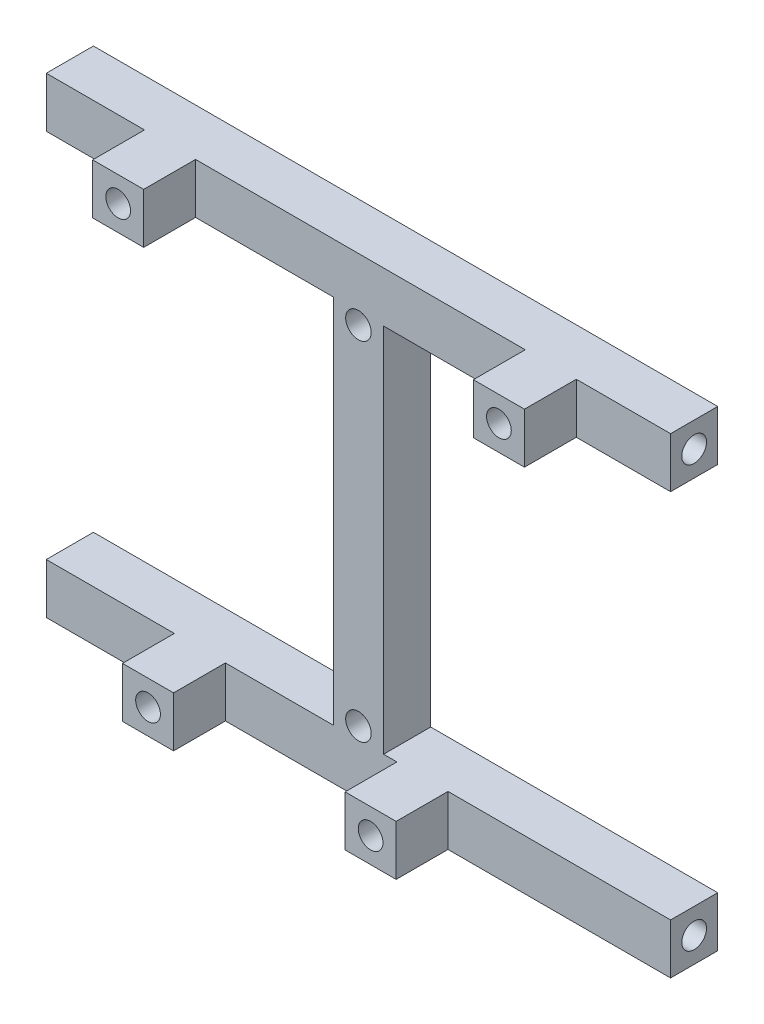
ISO-10303-21;
HEADER;
FILE_DESCRIPTION(('STEP AP214'),'2;1');
FILE_NAME('part.step','',(''),(''),'','','');
FILE_SCHEMA(('AUTOMOTIVE_DESIGN { 1 0 10303 214 1 1 1 1 }'));
ENDSEC;
DATA;
#1=APPLICATION_CONTEXT('core data for automotive mechanical design processes');
#2=APPLICATION_PROTOCOL_DEFINITION('international standard','automotive_design',2000,#1);
#3=PRODUCT_CONTEXT('',#1,'mechanical');
#4=PRODUCT('Part','Part','',(#3));
#5=PRODUCT_RELATED_PRODUCT_CATEGORY('part','',(#4));
#6=PRODUCT_DEFINITION_FORMATION('','',#4);
#7=PRODUCT_DEFINITION_CONTEXT('part definition',#1,'design');
#8=PRODUCT_DEFINITION('design','',#6,#7);
#9=PRODUCT_DEFINITION_SHAPE('','',#8);
#10=(LENGTH_UNIT() NAMED_UNIT(*) SI_UNIT(.MILLI.,.METRE.));
#11=(NAMED_UNIT(*) PLANE_ANGLE_UNIT() SI_UNIT($,.RADIAN.));
#12=(NAMED_UNIT(*) SI_UNIT($,.STERADIAN.) SOLID_ANGLE_UNIT());
#13=UNCERTAINTY_MEASURE_WITH_UNIT(LENGTH_MEASURE(1.E-05),#10,'distance_accuracy_value','');
#14=(GEOMETRIC_REPRESENTATION_CONTEXT(3) GLOBAL_UNCERTAINTY_ASSIGNED_CONTEXT((#13)) GLOBAL_UNIT_ASSIGNED_CONTEXT((#10,
#11,#12)) REPRESENTATION_CONTEXT('',''));
#15=CARTESIAN_POINT('',(0.,0.,0.));
#16=DIRECTION('',(0.,0.,1.));
#17=DIRECTION('',(1.,0.,0.));
#18=AXIS2_PLACEMENT_3D('',#15,#16,#17);
#19=CARTESIAN_POINT('',(0.,0.,6.));
#20=DIRECTION('',(0.,0.,-1.));
#21=DIRECTION('',(-1.,0.,0.));
#22=AXIS2_PLACEMENT_3D('',#19,#20,#21);
#23=PLANE('',#22);
#24=DIRECTION('',(0.,1.,0.));
#25=VECTOR('',#24,1.);
#26=CARTESIAN_POINT('',(11.4,-30.,6.));
#27=LINE('',#26,#25);
#28=CARTESIAN_POINT('',(11.4,-30.,6.));
#29=VERTEX_POINT('',#28);
#30=CARTESIAN_POINT('',(11.4,-23.6,6.));
#31=VERTEX_POINT('',#30);
#32=EDGE_CURVE('E48',#29,#31,#27,.T.);
#33=ORIENTED_EDGE('',*,*,#32,.F.);
#34=DIRECTION('',(1.,0.,0.));
#35=VECTOR('',#34,1.);
#36=CARTESIAN_POINT('',(-39.73,-30.,6.));
#37=LINE('',#36,#35);
#38=CARTESIAN_POINT('',(39.73,-30.,6.));
#39=VERTEX_POINT('',#38);
#40=EDGE_CURVE('E242',#29,#39,#37,.T.);
#41=ORIENTED_EDGE('',*,*,#40,.T.);
#42=DIRECTION('',(0.,1.,0.));
#43=VECTOR('',#42,1.);
#44=CARTESIAN_POINT('',(39.73,-23.6,6.));
#45=LINE('',#44,#43);
#46=CARTESIAN_POINT('',(39.73,-23.6,6.));
#47=VERTEX_POINT('',#46);
#48=EDGE_CURVE('E352',#39,#47,#45,.T.);
#49=ORIENTED_EDGE('',*,*,#48,.T.);
#50=DIRECTION('',(-1.,0.,0.));
#51=VECTOR('',#50,1.);
#52=CARTESIAN_POINT('',(3.20000000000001,-23.6,6.));
#53=LINE('',#52,#51);
#54=EDGE_CURVE('E355',#47,#31,#53,.T.);
#55=ORIENTED_EDGE('',*,*,#54,.T.);
#56=EDGE_LOOP('',(#33,#41,#49,#55));
#57=FACE_BOUND('',#56,.T.);
#58=ADVANCED_FACE('F33',(#57),#23,.F.);
#59=CARTESIAN_POINT('',(0.,22.1,6.));
#60=DIRECTION('',(0.,0.,1.));
#61=DIRECTION('',(1.,0.,0.));
#62=AXIS2_PLACEMENT_3D('',#59,#60,#61);
#63=CIRCLE('',#62,1.625);
#64=CARTESIAN_POINT('',(1.62500000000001,22.1,6.));
#65=VERTEX_POINT('',#64);
#66=EDGE_CURVE('E1034',#65,#65,#63,.T.);
#67=ORIENTED_EDGE('',*,*,#66,.F.);
#68=EDGE_LOOP('',(#67));
#69=FACE_BOUND('',#68,.T.);
#70=CARTESIAN_POINT('',(0.,-22.1,6.));
#71=DIRECTION('',(0.,0.,1.));
#72=DIRECTION('',(1.,0.,0.));
#73=AXIS2_PLACEMENT_3D('',#70,#71,#72);
#74=CIRCLE('',#73,1.625);
#75=CARTESIAN_POINT('',(1.62500000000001,-22.1,6.));
#76=VERTEX_POINT('',#75);
#77=EDGE_CURVE('E1025',#76,#76,#74,.T.);
#78=ORIENTED_EDGE('',*,*,#77,.F.);
#79=EDGE_LOOP('',(#78));
#80=FACE_BOUND('',#79,.T.);
#81=DIRECTION('',(0.,-1.,0.));
#82=VECTOR('',#81,1.);
#83=CARTESIAN_POINT('',(4.90000000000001,-30.,6.));
#84=LINE('',#83,#82);
#85=CARTESIAN_POINT('',(4.90000000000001,-23.6,6.));
#86=VERTEX_POINT('',#85);
#87=CARTESIAN_POINT('',(4.90000000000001,-30.,6.));
#88=VERTEX_POINT('',#87);
#89=EDGE_CURVE('E238',#86,#88,#84,.T.);
#90=ORIENTED_EDGE('',*,*,#89,.F.);
#91=CARTESIAN_POINT('',(3.20000000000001,-23.6,6.));
#92=VERTEX_POINT('',#91);
#93=EDGE_CURVE('E354',#86,#92,#53,.T.);
#94=ORIENTED_EDGE('',*,*,#93,.T.);
#95=DIRECTION('',(0.,1.,0.));
#96=VECTOR('',#95,1.);
#97=CARTESIAN_POINT('',(3.20000000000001,-23.6,6.));
#98=LINE('',#97,#96);
#99=CARTESIAN_POINT('',(3.20000000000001,23.6,6.));
#100=VERTEX_POINT('',#99);
#101=EDGE_CURVE('E357',#92,#100,#98,.T.);
#102=ORIENTED_EDGE('',*,*,#101,.T.);
#103=DIRECTION('',(1.,0.,0.));
#104=VECTOR('',#103,1.);
#105=CARTESIAN_POINT('',(3.20000000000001,23.6,6.));
#106=LINE('',#105,#104);
#107=CARTESIAN_POINT('',(21.23,23.6,6.));
#108=VERTEX_POINT('',#107);
#109=EDGE_CURVE('E360',#100,#108,#106,.T.);
#110=ORIENTED_EDGE('',*,*,#109,.T.);
#111=DIRECTION('',(0.,-1.,0.));
#112=VECTOR('',#111,1.);
#113=CARTESIAN_POINT('',(21.23,30.,6.));
#114=LINE('',#113,#112);
#115=CARTESIAN_POINT('',(21.23,30.,6.));
#116=VERTEX_POINT('',#115);
#117=EDGE_CURVE('E280',#116,#108,#114,.T.);
#118=ORIENTED_EDGE('',*,*,#117,.F.);
#119=DIRECTION('',(-1.,0.,0.));
#120=VECTOR('',#119,1.);
#121=CARTESIAN_POINT('',(-39.73,30.,6.));
#122=LINE('',#121,#120);
#123=CARTESIAN_POINT('',(-20.73,30.,6.));
#124=VERTEX_POINT('',#123);
#125=EDGE_CURVE('E338',#116,#124,#122,.T.);
#126=ORIENTED_EDGE('',*,*,#125,.T.);
#127=DIRECTION('',(0.,1.,0.));
#128=VECTOR('',#127,1.);
#129=CARTESIAN_POINT('',(-20.73,23.6,6.));
#130=LINE('',#129,#128);
#131=CARTESIAN_POINT('',(-20.73,23.6,6.));
#132=VERTEX_POINT('',#131);
#133=EDGE_CURVE('E302',#132,#124,#130,.T.);
#134=ORIENTED_EDGE('',*,*,#133,.F.);
#135=DIRECTION('',(1.,0.,0.));
#136=VECTOR('',#135,1.);
#137=CARTESIAN_POINT('',(-39.73,23.6,6.));
#138=LINE('',#137,#136);
#139=CARTESIAN_POINT('',(-3.19999999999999,23.6,6.));
#140=VERTEX_POINT('',#139);
#141=EDGE_CURVE('E340',#132,#140,#138,.T.);
#142=ORIENTED_EDGE('',*,*,#141,.T.);
#143=DIRECTION('',(0.,-1.,0.));
#144=VECTOR('',#143,1.);
#145=CARTESIAN_POINT('',(-3.19999999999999,-23.6,6.));
#146=LINE('',#145,#144);
#147=CARTESIAN_POINT('',(-3.19999999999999,-23.6,6.));
#148=VERTEX_POINT('',#147);
#149=EDGE_CURVE('E343',#140,#148,#146,.T.);
#150=ORIENTED_EDGE('',*,*,#149,.T.);
#151=DIRECTION('',(-1.,0.,0.));
#152=VECTOR('',#151,1.);
#153=CARTESIAN_POINT('',(-39.73,-23.6,6.));
#154=LINE('',#153,#152);
#155=CARTESIAN_POINT('',(-16.93,-23.6,6.));
#156=VERTEX_POINT('',#155);
#157=EDGE_CURVE('E346',#148,#156,#154,.T.);
#158=ORIENTED_EDGE('',*,*,#157,.T.);
#159=DIRECTION('',(0.,1.,0.));
#160=VECTOR('',#159,1.);
#161=CARTESIAN_POINT('',(-16.93,-30.,6.));
#162=LINE('',#161,#160);
#163=CARTESIAN_POINT('',(-16.93,-30.,6.));
#164=VERTEX_POINT('',#163);
#165=EDGE_CURVE('E246',#164,#156,#162,.T.);
#166=ORIENTED_EDGE('',*,*,#165,.F.);
#167=EDGE_CURVE('E56',#164,#88,#37,.T.);
#168=ORIENTED_EDGE('',*,*,#167,.T.);
#169=EDGE_LOOP('',(#90,#94,#102,#110,#118,#126,#134,#142,#150,#158,#166,#168));
#170=FACE_BOUND('',#169,.T.);
#171=ADVANCED_FACE('F439',(#69,#80,#170),#23,.F.);
#172=DIRECTION('',(0.,-1.,0.));
#173=VECTOR('',#172,1.);
#174=CARTESIAN_POINT('',(-23.43,-30.,6.));
#175=LINE('',#174,#173);
#176=CARTESIAN_POINT('',(-23.43,-23.6,6.));
#177=VERTEX_POINT('',#176);
#178=CARTESIAN_POINT('',(-23.43,-30.,6.));
#179=VERTEX_POINT('',#178);
#180=EDGE_CURVE('E243',#177,#179,#175,.T.);
#181=ORIENTED_EDGE('',*,*,#180,.F.);
#182=CARTESIAN_POINT('',(-39.73,-23.6,6.));
#183=VERTEX_POINT('',#182);
#184=EDGE_CURVE('E345',#177,#183,#154,.T.);
#185=ORIENTED_EDGE('',*,*,#184,.T.);
#186=DIRECTION('',(0.,-1.,0.));
#187=VECTOR('',#186,1.);
#188=CARTESIAN_POINT('',(-39.73,-30.,6.));
#189=LINE('',#188,#187);
#190=CARTESIAN_POINT('',(-39.73,-30.,6.));
#191=VERTEX_POINT('',#190);
#192=EDGE_CURVE('E348',#183,#191,#189,.T.);
#193=ORIENTED_EDGE('',*,*,#192,.T.);
#194=EDGE_CURVE('E350',#191,#179,#37,.T.);
#195=ORIENTED_EDGE('',*,*,#194,.T.);
#196=EDGE_LOOP('',(#181,#185,#193,#195));
#197=FACE_BOUND('',#196,.T.);
#198=ADVANCED_FACE('F541',(#197),#23,.F.);
#199=DIRECTION('',(0.,1.,0.));
#200=VECTOR('',#199,1.);
#201=CARTESIAN_POINT('',(27.73,30.,6.));
#202=LINE('',#201,#200);
#203=CARTESIAN_POINT('',(27.73,23.6,6.));
#204=VERTEX_POINT('',#203);
#205=CARTESIAN_POINT('',(27.73,30.,6.));
#206=VERTEX_POINT('',#205);
#207=EDGE_CURVE('E275',#204,#206,#202,.T.);
#208=ORIENTED_EDGE('',*,*,#207,.F.);
#209=CARTESIAN_POINT('',(39.73,23.6,6.));
#210=VERTEX_POINT('',#209);
#211=EDGE_CURVE('E359',#204,#210,#106,.T.);
#212=ORIENTED_EDGE('',*,*,#211,.T.);
#213=DIRECTION('',(0.,1.,0.));
#214=VECTOR('',#213,1.);
#215=CARTESIAN_POINT('',(39.73,23.6,6.));
#216=LINE('',#215,#214);
#217=CARTESIAN_POINT('',(39.73,30.,6.));
#218=VERTEX_POINT('',#217);
#219=EDGE_CURVE('E330',#210,#218,#216,.T.);
#220=ORIENTED_EDGE('',*,*,#219,.T.);
#221=EDGE_CURVE('E335',#218,#206,#122,.T.);
#222=ORIENTED_EDGE('',*,*,#221,.T.);
#223=EDGE_LOOP('',(#208,#212,#220,#222));
#224=FACE_BOUND('',#223,.T.);
#225=ADVANCED_FACE('F472',(#224),#23,.F.);
#226=DIRECTION('',(0.,-1.,0.));
#227=VECTOR('',#226,1.);
#228=CARTESIAN_POINT('',(-27.23,23.6,6.));
#229=LINE('',#228,#227);
#230=CARTESIAN_POINT('',(-27.23,30.,6.));
#231=VERTEX_POINT('',#230);
#232=CARTESIAN_POINT('',(-27.23,23.6,6.));
#233=VERTEX_POINT('',#232);
#234=EDGE_CURVE('E307',#231,#233,#229,.T.);
#235=ORIENTED_EDGE('',*,*,#234,.F.);
#236=CARTESIAN_POINT('',(-39.73,30.,6.));
#237=VERTEX_POINT('',#236);
#238=EDGE_CURVE('E333',#231,#237,#122,.T.);
#239=ORIENTED_EDGE('',*,*,#238,.T.);
#240=DIRECTION('',(0.,-1.,0.));
#241=VECTOR('',#240,1.);
#242=CARTESIAN_POINT('',(-39.73,23.6,6.));
#243=LINE('',#242,#241);
#244=CARTESIAN_POINT('',(-39.73,23.6,6.));
#245=VERTEX_POINT('',#244);
#246=EDGE_CURVE('E337',#237,#245,#243,.T.);
#247=ORIENTED_EDGE('',*,*,#246,.T.);
#248=EDGE_CURVE('E341',#245,#233,#138,.T.);
#249=ORIENTED_EDGE('',*,*,#248,.T.);
#250=EDGE_LOOP('',(#235,#239,#247,#249));
#251=FACE_BOUND('',#250,.T.);
#252=ADVANCED_FACE('F454',(#251),#23,.F.);
#253=CARTESIAN_POINT('',(39.73,23.6,6.));
#254=DIRECTION('',(-1.,0.,0.));
#255=DIRECTION('',(0.,0.,1.));
#256=AXIS2_PLACEMENT_3D('',#253,#254,#255);
#257=PLANE('',#256);
#258=CARTESIAN_POINT('',(39.73,26.8,3.));
#259=DIRECTION('',(1.,0.,0.));
#260=DIRECTION('',(0.,0.,-1.));
#261=AXIS2_PLACEMENT_3D('',#258,#259,#260);
#262=CIRCLE('',#261,1.575);
#263=CARTESIAN_POINT('',(39.73,26.8,1.425));
#264=VERTEX_POINT('',#263);
#265=EDGE_CURVE('E1007',#264,#264,#262,.T.);
#266=ORIENTED_EDGE('',*,*,#265,.F.);
#267=EDGE_LOOP('',(#266));
#268=FACE_BOUND('',#267,.T.);
#269=DIRECTION('',(0.,1.,0.));
#270=VECTOR('',#269,1.);
#271=CARTESIAN_POINT('',(39.73,23.6,0.));
#272=LINE('',#271,#270);
#273=CARTESIAN_POINT('',(39.73,23.6,0.));
#274=VERTEX_POINT('',#273);
#275=CARTESIAN_POINT('',(39.73,30.,0.));
#276=VERTEX_POINT('',#275);
#277=EDGE_CURVE('E329',#274,#276,#272,.T.);
#278=ORIENTED_EDGE('',*,*,#277,.T.);
#279=DIRECTION('',(0.,0.,-1.));
#280=VECTOR('',#279,1.);
#281=CARTESIAN_POINT('',(39.73,30.,6.));
#282=LINE('',#281,#280);
#283=EDGE_CURVE('E11',#218,#276,#282,.T.);
#284=ORIENTED_EDGE('',*,*,#283,.F.);
#285=ORIENTED_EDGE('',*,*,#219,.F.);
#286=DIRECTION('',(0.,0.,-1.));
#287=VECTOR('',#286,1.);
#288=CARTESIAN_POINT('',(39.73,23.6,6.));
#289=LINE('',#288,#287);
#290=EDGE_CURVE('E362',#210,#274,#289,.T.);
#291=ORIENTED_EDGE('',*,*,#290,.T.);
#292=EDGE_LOOP('',(#278,#284,#285,#291));
#293=FACE_BOUND('',#292,.T.);
#294=ADVANCED_FACE('F35',(#268,#293),#257,.F.);
#295=CARTESIAN_POINT('',(-39.73,30.,6.));
#296=DIRECTION('',(0.,-1.,0.));
#297=DIRECTION('',(0.,0.,-1.));
#298=AXIS2_PLACEMENT_3D('',#295,#296,#297);
#299=PLANE('',#298);
#300=DIRECTION('',(-1.,0.,0.));
#301=VECTOR('',#300,1.);
#302=CARTESIAN_POINT('',(-39.73,30.,0.));
#303=LINE('',#302,#301);
#304=CARTESIAN_POINT('',(-39.73,30.,0.));
#305=VERTEX_POINT('',#304);
#306=EDGE_CURVE('E365',#276,#305,#303,.T.);
#307=ORIENTED_EDGE('',*,*,#306,.T.);
#308=DIRECTION('',(0.,0.,-1.));
#309=VECTOR('',#308,1.);
#310=CARTESIAN_POINT('',(-39.73,30.,6.));
#311=LINE('',#310,#309);
#312=EDGE_CURVE('E41',#237,#305,#311,.T.);
#313=ORIENTED_EDGE('',*,*,#312,.F.);
#314=ORIENTED_EDGE('',*,*,#238,.F.);
#315=DIRECTION('',(0.,0.,-1.));
#316=VECTOR('',#315,1.);
#317=CARTESIAN_POINT('',(-27.23,30.,12.6));
#318=LINE('',#317,#316);
#319=CARTESIAN_POINT('',(-27.23,30.,12.6));
#320=VERTEX_POINT('',#319);
#321=EDGE_CURVE('E320',#320,#231,#318,.T.);
#322=ORIENTED_EDGE('',*,*,#321,.F.);
#323=DIRECTION('',(-1.,0.,0.));
#324=VECTOR('',#323,1.);
#325=CARTESIAN_POINT('',(-27.23,30.,12.6));
#326=LINE('',#325,#324);
#327=CARTESIAN_POINT('',(-20.73,30.,12.6));
#328=VERTEX_POINT('',#327);
#329=EDGE_CURVE('E309',#328,#320,#326,.T.);
#330=ORIENTED_EDGE('',*,*,#329,.F.);
#331=DIRECTION('',(0.,0.,-1.));
#332=VECTOR('',#331,1.);
#333=CARTESIAN_POINT('',(-20.73,30.,12.6));
#334=LINE('',#333,#332);
#335=EDGE_CURVE('E323',#328,#124,#334,.T.);
#336=ORIENTED_EDGE('',*,*,#335,.T.);
#337=ORIENTED_EDGE('',*,*,#125,.F.);
#338=DIRECTION('',(0.,0.,-1.));
#339=VECTOR('',#338,1.);
#340=CARTESIAN_POINT('',(21.23,30.,12.6));
#341=LINE('',#340,#339);
#342=CARTESIAN_POINT('',(21.23,30.,12.6));
#343=VERTEX_POINT('',#342);
#344=EDGE_CURVE('E296',#343,#116,#341,.T.);
#345=ORIENTED_EDGE('',*,*,#344,.F.);
#346=DIRECTION('',(-1.,0.,0.));
#347=VECTOR('',#346,1.);
#348=CARTESIAN_POINT('',(27.73,30.,12.6));
#349=LINE('',#348,#347);
#350=CARTESIAN_POINT('',(27.73,30.,12.6));
#351=VERTEX_POINT('',#350);
#352=EDGE_CURVE('E279',#351,#343,#349,.T.);
#353=ORIENTED_EDGE('',*,*,#352,.F.);
#354=DIRECTION('',(0.,0.,-1.));
#355=VECTOR('',#354,1.);
#356=CARTESIAN_POINT('',(27.73,30.,12.6));
#357=LINE('',#356,#355);
#358=EDGE_CURVE('E299',#351,#206,#357,.T.);
#359=ORIENTED_EDGE('',*,*,#358,.T.);
#360=ORIENTED_EDGE('',*,*,#221,.F.);
#361=ORIENTED_EDGE('',*,*,#283,.T.);
#362=EDGE_LOOP('',(#307,#313,#314,#322,#330,#336,#337,#345,#353,#359,#360,#361));
#363=FACE_BOUND('',#362,.T.);
#364=ADVANCED_FACE('F455',(#363),#299,.F.);
#365=CARTESIAN_POINT('',(-39.73,23.6,6.));
#366=DIRECTION('',(1.,0.,0.));
#367=DIRECTION('',(0.,0.,-1.));
#368=AXIS2_PLACEMENT_3D('',#365,#366,#367);
#369=PLANE('',#368);
#370=CARTESIAN_POINT('',(-39.73,26.8,3.));
#371=DIRECTION('',(-1.,0.,0.));
#372=DIRECTION('',(0.,0.,1.));
#373=AXIS2_PLACEMENT_3D('',#370,#371,#372);
#374=CIRCLE('',#373,1.575);
#375=CARTESIAN_POINT('',(-39.73,26.8,4.575));
#376=VERTEX_POINT('',#375);
#377=EDGE_CURVE('E1008',#376,#376,#374,.T.);
#378=ORIENTED_EDGE('',*,*,#377,.F.);
#379=EDGE_LOOP('',(#378));
#380=FACE_BOUND('',#379,.T.);
#381=DIRECTION('',(0.,-1.,0.));
#382=VECTOR('',#381,1.);
#383=CARTESIAN_POINT('',(-39.73,23.6,0.));
#384=LINE('',#383,#382);
#385=CARTESIAN_POINT('',(-39.73,23.6,0.));
#386=VERTEX_POINT('',#385);
#387=EDGE_CURVE('E367',#305,#386,#384,.T.);
#388=ORIENTED_EDGE('',*,*,#387,.T.);
#389=DIRECTION('',(0.,0.,-1.));
#390=VECTOR('',#389,1.);
#391=CARTESIAN_POINT('',(-39.73,23.6,6.));
#392=LINE('',#391,#390);
#393=EDGE_CURVE('E412',#245,#386,#392,.T.);
#394=ORIENTED_EDGE('',*,*,#393,.F.);
#395=ORIENTED_EDGE('',*,*,#246,.F.);
#396=ORIENTED_EDGE('',*,*,#312,.T.);
#397=EDGE_LOOP('',(#388,#394,#395,#396));
#398=FACE_BOUND('',#397,.T.);
#399=ADVANCED_FACE('F419',(#380,#398),#369,.F.);
#400=CARTESIAN_POINT('',(-39.73,23.6,6.));
#401=DIRECTION('',(0.,1.,0.));
#402=DIRECTION('',(0.,0.,1.));
#403=AXIS2_PLACEMENT_3D('',#400,#401,#402);
#404=PLANE('',#403);
#405=DIRECTION('',(1.,0.,0.));
#406=VECTOR('',#405,1.);
#407=CARTESIAN_POINT('',(-39.73,23.6,0.));
#408=LINE('',#407,#406);
#409=CARTESIAN_POINT('',(-3.19999999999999,23.6,0.));
#410=VERTEX_POINT('',#409);
#411=EDGE_CURVE('E369',#386,#410,#408,.T.);
#412=ORIENTED_EDGE('',*,*,#411,.T.);
#413=DIRECTION('',(0.,0.,-1.));
#414=VECTOR('',#413,1.);
#415=CARTESIAN_POINT('',(-3.19999999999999,23.6,6.));
#416=LINE('',#415,#414);
#417=EDGE_CURVE('E409',#140,#410,#416,.T.);
#418=ORIENTED_EDGE('',*,*,#417,.F.);
#419=ORIENTED_EDGE('',*,*,#141,.F.);
#420=DIRECTION('',(0.,0.,-1.));
#421=VECTOR('',#420,1.);
#422=CARTESIAN_POINT('',(-20.73,23.6,12.6));
#423=LINE('',#422,#421);
#424=CARTESIAN_POINT('',(-20.73,23.6,12.6));
#425=VERTEX_POINT('',#424);
#426=EDGE_CURVE('E326',#425,#132,#423,.T.);
#427=ORIENTED_EDGE('',*,*,#426,.F.);
#428=DIRECTION('',(1.,0.,0.));
#429=VECTOR('',#428,1.);
#430=CARTESIAN_POINT('',(-20.73,23.6,12.6));
#431=LINE('',#430,#429);
#432=CARTESIAN_POINT('',(-27.23,23.6,12.6));
#433=VERTEX_POINT('',#432);
#434=EDGE_CURVE('E303',#433,#425,#431,.T.);
#435=ORIENTED_EDGE('',*,*,#434,.F.);
#436=DIRECTION('',(0.,0.,-1.));
#437=VECTOR('',#436,1.);
#438=CARTESIAN_POINT('',(-27.23,23.6,12.6));
#439=LINE('',#438,#437);
#440=EDGE_CURVE('E313',#433,#233,#439,.T.);
#441=ORIENTED_EDGE('',*,*,#440,.T.);
#442=ORIENTED_EDGE('',*,*,#248,.F.);
#443=ORIENTED_EDGE('',*,*,#393,.T.);
#444=EDGE_LOOP('',(#412,#418,#419,#427,#435,#441,#442,#443));
#445=FACE_BOUND('',#444,.T.);
#446=ADVANCED_FACE('F431',(#445),#404,.F.);
#447=CARTESIAN_POINT('',(-3.19999999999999,-23.6,6.));
#448=DIRECTION('',(1.,0.,0.));
#449=DIRECTION('',(0.,0.,-1.));
#450=AXIS2_PLACEMENT_3D('',#447,#448,#449);
#451=PLANE('',#450);
#452=DIRECTION('',(0.,-1.,0.));
#453=VECTOR('',#452,1.);
#454=CARTESIAN_POINT('',(-3.19999999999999,-23.6,0.));
#455=LINE('',#454,#453);
#456=CARTESIAN_POINT('',(-3.19999999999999,-23.6,0.));
#457=VERTEX_POINT('',#456);
#458=EDGE_CURVE('E371',#410,#457,#455,.T.);
#459=ORIENTED_EDGE('',*,*,#458,.T.);
#460=DIRECTION('',(0.,0.,-1.));
#461=VECTOR('',#460,1.);
#462=CARTESIAN_POINT('',(-3.19999999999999,-23.6,6.));
#463=LINE('',#462,#461);
#464=EDGE_CURVE('E406',#148,#457,#463,.T.);
#465=ORIENTED_EDGE('',*,*,#464,.F.);
#466=ORIENTED_EDGE('',*,*,#149,.F.);
#467=ORIENTED_EDGE('',*,*,#417,.T.);
#468=EDGE_LOOP('',(#459,#465,#466,#467));
#469=FACE_BOUND('',#468,.T.);
#470=ADVANCED_FACE('F436',(#469),#451,.F.);
#471=CARTESIAN_POINT('',(-39.73,-23.6,6.));
#472=DIRECTION('',(0.,-1.,0.));
#473=DIRECTION('',(0.,0.,-1.));
#474=AXIS2_PLACEMENT_3D('',#471,#472,#473);
#475=PLANE('',#474);
#476=DIRECTION('',(-1.,0.,0.));
#477=VECTOR('',#476,1.);
#478=CARTESIAN_POINT('',(-39.73,-23.6,0.));
#479=LINE('',#478,#477);
#480=CARTESIAN_POINT('',(-39.73,-23.6,0.));
#481=VERTEX_POINT('',#480);
#482=EDGE_CURVE('E373',#457,#481,#479,.T.);
#483=ORIENTED_EDGE('',*,*,#482,.T.);
#484=DIRECTION('',(0.,0.,-1.));
#485=VECTOR('',#484,1.);
#486=CARTESIAN_POINT('',(-39.73,-23.6,6.));
#487=LINE('',#486,#485);
#488=EDGE_CURVE('E403',#183,#481,#487,.T.);
#489=ORIENTED_EDGE('',*,*,#488,.F.);
#490=ORIENTED_EDGE('',*,*,#184,.F.);
#491=DIRECTION('',(0.,0.,-1.));
#492=VECTOR('',#491,1.);
#493=CARTESIAN_POINT('',(-23.43,-23.6,12.6));
#494=LINE('',#493,#492);
#495=CARTESIAN_POINT('',(-23.43,-23.6,12.6));
#496=VERTEX_POINT('',#495);
#497=EDGE_CURVE('E260',#496,#177,#494,.T.);
#498=ORIENTED_EDGE('',*,*,#497,.F.);
#499=DIRECTION('',(-1.,0.,0.));
#500=VECTOR('',#499,1.);
#501=CARTESIAN_POINT('',(-16.93,-23.6,12.6));
#502=LINE('',#501,#500);
#503=CARTESIAN_POINT('',(-16.93,-23.6,12.6));
#504=VERTEX_POINT('',#503);
#505=EDGE_CURVE('E259',#504,#496,#502,.T.);
#506=ORIENTED_EDGE('',*,*,#505,.F.);
#507=DIRECTION('',(0.,0.,-1.));
#508=VECTOR('',#507,1.);
#509=CARTESIAN_POINT('',(-16.93,-23.6,12.6));
#510=LINE('',#509,#508);
#511=EDGE_CURVE('E266',#504,#156,#510,.T.);
#512=ORIENTED_EDGE('',*,*,#511,.T.);
#513=ORIENTED_EDGE('',*,*,#157,.F.);
#514=ORIENTED_EDGE('',*,*,#464,.T.);
#515=EDGE_LOOP('',(#483,#489,#490,#498,#506,#512,#513,#514));
#516=FACE_BOUND('',#515,.T.);
#517=ADVANCED_FACE('F506',(#516),#475,.F.);
#518=CARTESIAN_POINT('',(-39.73,-30.,6.));
#519=DIRECTION('',(1.,0.,0.));
#520=DIRECTION('',(0.,0.,-1.));
#521=AXIS2_PLACEMENT_3D('',#518,#519,#520);
#522=PLANE('',#521);
#523=CARTESIAN_POINT('',(-39.73,-26.8,3.));
#524=DIRECTION('',(-1.,0.,0.));
#525=DIRECTION('',(0.,0.,1.));
#526=AXIS2_PLACEMENT_3D('',#523,#524,#525);
#527=CIRCLE('',#526,1.575);
#528=CARTESIAN_POINT('',(-39.73,-26.8,4.575));
#529=VERTEX_POINT('',#528);
#530=EDGE_CURVE('E1019',#529,#529,#527,.T.);
#531=ORIENTED_EDGE('',*,*,#530,.F.);
#532=EDGE_LOOP('',(#531));
#533=FACE_BOUND('',#532,.T.);
#534=DIRECTION('',(0.,-1.,0.));
#535=VECTOR('',#534,1.);
#536=CARTESIAN_POINT('',(-39.73,-30.,0.));
#537=LINE('',#536,#535);
#538=CARTESIAN_POINT('',(-39.73,-30.,0.));
#539=VERTEX_POINT('',#538);
#540=EDGE_CURVE('E375',#481,#539,#537,.T.);
#541=ORIENTED_EDGE('',*,*,#540,.T.);
#542=DIRECTION('',(0.,0.,-1.));
#543=VECTOR('',#542,1.);
#544=CARTESIAN_POINT('',(-39.73,-30.,6.));
#545=LINE('',#544,#543);
#546=EDGE_CURVE('E400',#191,#539,#545,.T.);
#547=ORIENTED_EDGE('',*,*,#546,.F.);
#548=ORIENTED_EDGE('',*,*,#192,.F.);
#549=ORIENTED_EDGE('',*,*,#488,.T.);
#550=EDGE_LOOP('',(#541,#547,#548,#549));
#551=FACE_BOUND('',#550,.T.);
#552=ADVANCED_FACE('F503',(#533,#551),#522,.F.);
#553=CARTESIAN_POINT('',(-39.73,-30.,6.));
#554=DIRECTION('',(0.,1.,0.));
#555=DIRECTION('',(0.,0.,1.));
#556=AXIS2_PLACEMENT_3D('',#553,#554,#555);
#557=PLANE('',#556);
#558=DIRECTION('',(1.,0.,0.));
#559=VECTOR('',#558,1.);
#560=CARTESIAN_POINT('',(-39.73,-30.,0.));
#561=LINE('',#560,#559);
#562=CARTESIAN_POINT('',(39.73,-30.,0.));
#563=VERTEX_POINT('',#562);
#564=EDGE_CURVE('E377',#539,#563,#561,.T.);
#565=ORIENTED_EDGE('',*,*,#564,.T.);
#566=DIRECTION('',(0.,0.,-1.));
#567=VECTOR('',#566,1.);
#568=CARTESIAN_POINT('',(39.73,-30.,6.));
#569=LINE('',#568,#567);
#570=EDGE_CURVE('E397',#39,#563,#569,.T.);
#571=ORIENTED_EDGE('',*,*,#570,.F.);
#572=ORIENTED_EDGE('',*,*,#40,.F.);
#573=DIRECTION('',(0.,0.,-1.));
#574=VECTOR('',#573,1.);
#575=CARTESIAN_POINT('',(11.4,-30.,12.6));
#576=LINE('',#575,#574);
#577=CARTESIAN_POINT('',(11.4,-30.,12.6));
#578=VERTEX_POINT('',#577);
#579=EDGE_CURVE('E223',#578,#29,#576,.T.);
#580=ORIENTED_EDGE('',*,*,#579,.F.);
#581=DIRECTION('',(1.,0.,0.));
#582=VECTOR('',#581,1.);
#583=CARTESIAN_POINT('',(11.4,-30.,12.6));
#584=LINE('',#583,#582);
#585=CARTESIAN_POINT('',(4.90000000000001,-30.,12.6));
#586=VERTEX_POINT('',#585);
#587=EDGE_CURVE('E229',#586,#578,#584,.T.);
#588=ORIENTED_EDGE('',*,*,#587,.F.);
#589=DIRECTION('',(0.,0.,-1.));
#590=VECTOR('',#589,1.);
#591=CARTESIAN_POINT('',(4.90000000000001,-30.,12.6));
#592=LINE('',#591,#590);
#593=EDGE_CURVE('E515',#586,#88,#592,.T.);
#594=ORIENTED_EDGE('',*,*,#593,.T.);
#595=ORIENTED_EDGE('',*,*,#167,.F.);
#596=DIRECTION('',(0.,0.,-1.));
#597=VECTOR('',#596,1.);
#598=CARTESIAN_POINT('',(-16.93,-30.,12.6));
#599=LINE('',#598,#597);
#600=CARTESIAN_POINT('',(-16.93,-30.,12.6));
#601=VERTEX_POINT('',#600);
#602=EDGE_CURVE('E269',#601,#164,#599,.T.);
#603=ORIENTED_EDGE('',*,*,#602,.F.);
#604=DIRECTION('',(1.,0.,0.));
#605=VECTOR('',#604,1.);
#606=CARTESIAN_POINT('',(-23.43,-30.,12.6));
#607=LINE('',#606,#605);
#608=CARTESIAN_POINT('',(-23.43,-30.,12.6));
#609=VERTEX_POINT('',#608);
#610=EDGE_CURVE('E255',#609,#601,#607,.T.);
#611=ORIENTED_EDGE('',*,*,#610,.F.);
#612=DIRECTION('',(0.,0.,-1.));
#613=VECTOR('',#612,1.);
#614=CARTESIAN_POINT('',(-23.43,-30.,12.6));
#615=LINE('',#614,#613);
#616=EDGE_CURVE('E272',#609,#179,#615,.T.);
#617=ORIENTED_EDGE('',*,*,#616,.T.);
#618=ORIENTED_EDGE('',*,*,#194,.F.);
#619=ORIENTED_EDGE('',*,*,#546,.T.);
#620=EDGE_LOOP('',(#565,#571,#572,#580,#588,#594,#595,#603,#611,#617,#618,#619));
#621=FACE_BOUND('',#620,.T.);
#622=ADVANCED_FACE('F240',(#621),#557,.F.);
#623=CARTESIAN_POINT('',(39.73,-23.6,6.));
#624=DIRECTION('',(-1.,0.,0.));
#625=DIRECTION('',(0.,0.,1.));
#626=AXIS2_PLACEMENT_3D('',#623,#624,#625);
#627=PLANE('',#626);
#628=CARTESIAN_POINT('',(39.73,-26.8,3.));
#629=DIRECTION('',(1.,0.,0.));
#630=DIRECTION('',(0.,0.,-1.));
#631=AXIS2_PLACEMENT_3D('',#628,#629,#630);
#632=CIRCLE('',#631,1.575);
#633=CARTESIAN_POINT('',(39.73,-26.8,1.425));
#634=VERTEX_POINT('',#633);
#635=EDGE_CURVE('E1026',#634,#634,#632,.T.);
#636=ORIENTED_EDGE('',*,*,#635,.F.);
#637=EDGE_LOOP('',(#636));
#638=FACE_BOUND('',#637,.T.);
#639=DIRECTION('',(0.,1.,0.));
#640=VECTOR('',#639,1.);
#641=CARTESIAN_POINT('',(39.73,-23.6,0.));
#642=LINE('',#641,#640);
#643=CARTESIAN_POINT('',(39.73,-23.6,0.));
#644=VERTEX_POINT('',#643);
#645=EDGE_CURVE('E379',#563,#644,#642,.T.);
#646=ORIENTED_EDGE('',*,*,#645,.T.);
#647=DIRECTION('',(0.,0.,-1.));
#648=VECTOR('',#647,1.);
#649=CARTESIAN_POINT('',(39.73,-23.6,6.));
#650=LINE('',#649,#648);
#651=EDGE_CURVE('E394',#47,#644,#650,.T.);
#652=ORIENTED_EDGE('',*,*,#651,.F.);
#653=ORIENTED_EDGE('',*,*,#48,.F.);
#654=ORIENTED_EDGE('',*,*,#570,.T.);
#655=EDGE_LOOP('',(#646,#652,#653,#654));
#656=FACE_BOUND('',#655,.T.);
#657=ADVANCED_FACE('F497',(#638,#656),#627,.F.);
#658=CARTESIAN_POINT('',(3.20000000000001,-23.6,6.));
#659=DIRECTION('',(0.,-1.,0.));
#660=DIRECTION('',(0.,0.,-1.));
#661=AXIS2_PLACEMENT_3D('',#658,#659,#660);
#662=PLANE('',#661);
#663=DIRECTION('',(-1.,0.,0.));
#664=VECTOR('',#663,1.);
#665=CARTESIAN_POINT('',(3.20000000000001,-23.6,0.));
#666=LINE('',#665,#664);
#667=CARTESIAN_POINT('',(3.20000000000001,-23.6,0.));
#668=VERTEX_POINT('',#667);
#669=EDGE_CURVE('E381',#644,#668,#666,.T.);
#670=ORIENTED_EDGE('',*,*,#669,.T.);
#671=DIRECTION('',(0.,0.,-1.));
#672=VECTOR('',#671,1.);
#673=CARTESIAN_POINT('',(3.20000000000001,-23.6,6.));
#674=LINE('',#673,#672);
#675=EDGE_CURVE('E391',#92,#668,#674,.T.);
#676=ORIENTED_EDGE('',*,*,#675,.F.);
#677=ORIENTED_EDGE('',*,*,#93,.F.);
#678=DIRECTION('',(0.,0.,-1.));
#679=VECTOR('',#678,1.);
#680=CARTESIAN_POINT('',(4.90000000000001,-23.6,12.6));
#681=LINE('',#680,#679);
#682=CARTESIAN_POINT('',(4.90000000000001,-23.6,12.6));
#683=VERTEX_POINT('',#682);
#684=EDGE_CURVE('E248',#683,#86,#681,.T.);
#685=ORIENTED_EDGE('',*,*,#684,.F.);
#686=DIRECTION('',(-1.,0.,0.));
#687=VECTOR('',#686,1.);
#688=CARTESIAN_POINT('',(4.90000000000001,-23.6,12.6));
#689=LINE('',#688,#687);
#690=CARTESIAN_POINT('',(11.4,-23.6,12.6));
#691=VERTEX_POINT('',#690);
#692=EDGE_CURVE('E228',#691,#683,#689,.T.);
#693=ORIENTED_EDGE('',*,*,#692,.F.);
#694=DIRECTION('',(0.,0.,-1.));
#695=VECTOR('',#694,1.);
#696=CARTESIAN_POINT('',(11.4,-23.6,12.6));
#697=LINE('',#696,#695);
#698=EDGE_CURVE('E225',#691,#31,#697,.T.);
#699=ORIENTED_EDGE('',*,*,#698,.T.);
#700=ORIENTED_EDGE('',*,*,#54,.F.);
#701=ORIENTED_EDGE('',*,*,#651,.T.);
#702=EDGE_LOOP('',(#670,#676,#677,#685,#693,#699,#700,#701));
#703=FACE_BOUND('',#702,.T.);
#704=ADVANCED_FACE('F489',(#703),#662,.F.);
#705=CARTESIAN_POINT('',(3.20000000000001,-23.6,6.));
#706=DIRECTION('',(-1.,0.,0.));
#707=DIRECTION('',(0.,0.,1.));
#708=AXIS2_PLACEMENT_3D('',#705,#706,#707);
#709=PLANE('',#708);
#710=DIRECTION('',(0.,1.,0.));
#711=VECTOR('',#710,1.);
#712=CARTESIAN_POINT('',(3.20000000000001,-23.6,0.));
#713=LINE('',#712,#711);
#714=CARTESIAN_POINT('',(3.20000000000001,23.6,0.));
#715=VERTEX_POINT('',#714);
#716=EDGE_CURVE('E383',#668,#715,#713,.T.);
#717=ORIENTED_EDGE('',*,*,#716,.T.);
#718=DIRECTION('',(0.,0.,-1.));
#719=VECTOR('',#718,1.);
#720=CARTESIAN_POINT('',(3.20000000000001,23.6,6.));
#721=LINE('',#720,#719);
#722=EDGE_CURVE('E388',#100,#715,#721,.T.);
#723=ORIENTED_EDGE('',*,*,#722,.F.);
#724=ORIENTED_EDGE('',*,*,#101,.F.);
#725=ORIENTED_EDGE('',*,*,#675,.T.);
#726=EDGE_LOOP('',(#717,#723,#724,#725));
#727=FACE_BOUND('',#726,.T.);
#728=ADVANCED_FACE('F486',(#727),#709,.F.);
#729=CARTESIAN_POINT('',(3.20000000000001,23.6,6.));
#730=DIRECTION('',(0.,1.,0.));
#731=DIRECTION('',(0.,0.,1.));
#732=AXIS2_PLACEMENT_3D('',#729,#730,#731);
#733=PLANE('',#732);
#734=DIRECTION('',(1.,0.,0.));
#735=VECTOR('',#734,1.);
#736=CARTESIAN_POINT('',(3.20000000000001,23.6,0.));
#737=LINE('',#736,#735);
#738=EDGE_CURVE('E334',#715,#274,#737,.T.);
#739=ORIENTED_EDGE('',*,*,#738,.T.);
#740=ORIENTED_EDGE('',*,*,#290,.F.);
#741=ORIENTED_EDGE('',*,*,#211,.F.);
#742=DIRECTION('',(0.,0.,-1.));
#743=VECTOR('',#742,1.);
#744=CARTESIAN_POINT('',(27.73,23.6,12.6));
#745=LINE('',#744,#743);
#746=CARTESIAN_POINT('',(27.73,23.6,12.6));
#747=VERTEX_POINT('',#746);
#748=EDGE_CURVE('E286',#747,#204,#745,.T.);
#749=ORIENTED_EDGE('',*,*,#748,.F.);
#750=DIRECTION('',(1.,0.,0.));
#751=VECTOR('',#750,1.);
#752=CARTESIAN_POINT('',(21.23,23.6,12.6));
#753=LINE('',#752,#751);
#754=CARTESIAN_POINT('',(21.23,23.6,12.6));
#755=VERTEX_POINT('',#754);
#756=EDGE_CURVE('E284',#755,#747,#753,.T.);
#757=ORIENTED_EDGE('',*,*,#756,.F.);
#758=DIRECTION('',(0.,0.,-1.));
#759=VECTOR('',#758,1.);
#760=CARTESIAN_POINT('',(21.23,23.6,12.6));
#761=LINE('',#760,#759);
#762=EDGE_CURVE('E293',#755,#108,#761,.T.);
#763=ORIENTED_EDGE('',*,*,#762,.T.);
#764=ORIENTED_EDGE('',*,*,#109,.F.);
#765=ORIENTED_EDGE('',*,*,#722,.T.);
#766=EDGE_LOOP('',(#739,#740,#741,#749,#757,#763,#764,#765));
#767=FACE_BOUND('',#766,.T.);
#768=ADVANCED_FACE('F481',(#767),#733,.F.);
#769=CARTESIAN_POINT('',(0.,0.,0.));
#770=DIRECTION('',(0.,0.,-1.));
#771=DIRECTION('',(-1.,0.,0.));
#772=AXIS2_PLACEMENT_3D('',#769,#770,#771);
#773=PLANE('',#772);
#774=CARTESIAN_POINT('',(0.,22.1,0.));
#775=DIRECTION('',(0.,0.,1.));
#776=DIRECTION('',(1.,0.,0.));
#777=AXIS2_PLACEMENT_3D('',#774,#775,#776);
#778=CIRCLE('',#777,1.625);
#779=CARTESIAN_POINT('',(1.62500000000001,22.1,0.));
#780=VERTEX_POINT('',#779);
#781=EDGE_CURVE('E1031',#780,#780,#778,.T.);
#782=ORIENTED_EDGE('',*,*,#781,.T.);
#783=EDGE_LOOP('',(#782));
#784=FACE_BOUND('',#783,.T.);
#785=CARTESIAN_POINT('',(0.,-22.1,0.));
#786=DIRECTION('',(0.,0.,1.));
#787=DIRECTION('',(1.,0.,0.));
#788=AXIS2_PLACEMENT_3D('',#785,#786,#787);
#789=CIRCLE('',#788,1.625);
#790=CARTESIAN_POINT('',(1.62500000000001,-22.1,0.));
#791=VERTEX_POINT('',#790);
#792=EDGE_CURVE('E1037',#791,#791,#789,.T.);
#793=ORIENTED_EDGE('',*,*,#792,.T.);
#794=EDGE_LOOP('',(#793));
#795=FACE_BOUND('',#794,.T.);
#796=ORIENTED_EDGE('',*,*,#277,.F.);
#797=ORIENTED_EDGE('',*,*,#738,.F.);
#798=ORIENTED_EDGE('',*,*,#716,.F.);
#799=ORIENTED_EDGE('',*,*,#669,.F.);
#800=ORIENTED_EDGE('',*,*,#645,.F.);
#801=ORIENTED_EDGE('',*,*,#564,.F.);
#802=ORIENTED_EDGE('',*,*,#540,.F.);
#803=ORIENTED_EDGE('',*,*,#482,.F.);
#804=ORIENTED_EDGE('',*,*,#458,.F.);
#805=ORIENTED_EDGE('',*,*,#411,.F.);
#806=ORIENTED_EDGE('',*,*,#387,.F.);
#807=ORIENTED_EDGE('',*,*,#306,.F.);
#808=EDGE_LOOP('',(#796,#797,#798,#799,#800,#801,#802,#803,#804,#805,#806,#807));
#809=FACE_BOUND('',#808,.T.);
#810=ADVANCED_FACE('F426',(#784,#795,#809),#773,.T.);
#811=CARTESIAN_POINT('',(-20.73,23.6,12.6));
#812=DIRECTION('',(-1.,0.,0.));
#813=DIRECTION('',(0.,0.,1.));
#814=AXIS2_PLACEMENT_3D('',#811,#812,#813);
#815=PLANE('',#814);
#816=ORIENTED_EDGE('',*,*,#133,.T.);
#817=ORIENTED_EDGE('',*,*,#335,.F.);
#818=DIRECTION('',(0.,1.,0.));
#819=VECTOR('',#818,1.);
#820=CARTESIAN_POINT('',(-20.73,23.6,12.6));
#821=LINE('',#820,#819);
#822=EDGE_CURVE('E306',#425,#328,#821,.T.);
#823=ORIENTED_EDGE('',*,*,#822,.F.);
#824=ORIENTED_EDGE('',*,*,#426,.T.);
#825=EDGE_LOOP('',(#816,#817,#823,#824));
#826=FACE_BOUND('',#825,.T.);
#827=ADVANCED_FACE('F443',(#826),#815,.F.);
#828=CARTESIAN_POINT('',(-27.23,23.6,12.6));
#829=DIRECTION('',(1.,0.,0.));
#830=DIRECTION('',(0.,0.,-1.));
#831=AXIS2_PLACEMENT_3D('',#828,#829,#830);
#832=PLANE('',#831);
#833=ORIENTED_EDGE('',*,*,#234,.T.);
#834=ORIENTED_EDGE('',*,*,#440,.F.);
#835=DIRECTION('',(0.,-1.,0.));
#836=VECTOR('',#835,1.);
#837=CARTESIAN_POINT('',(-27.23,23.6,12.6));
#838=LINE('',#837,#836);
#839=EDGE_CURVE('E311',#320,#433,#838,.T.);
#840=ORIENTED_EDGE('',*,*,#839,.F.);
#841=ORIENTED_EDGE('',*,*,#321,.T.);
#842=EDGE_LOOP('',(#833,#834,#840,#841));
#843=FACE_BOUND('',#842,.T.);
#844=ADVANCED_FACE('F451',(#843),#832,.F.);
#845=CARTESIAN_POINT('',(0.,0.,12.6));
#846=DIRECTION('',(0.,0.,-1.));
#847=DIRECTION('',(-1.,0.,0.));
#848=AXIS2_PLACEMENT_3D('',#845,#846,#847);
#849=PLANE('',#848);
#850=CARTESIAN_POINT('',(-23.98,26.8,12.6));
#851=DIRECTION('',(0.,0.,1.));
#852=DIRECTION('',(1.,0.,0.));
#853=AXIS2_PLACEMENT_3D('',#850,#851,#852);
#854=CIRCLE('',#853,1.575);
#855=CARTESIAN_POINT('',(-22.405,26.8,12.6));
#856=VERTEX_POINT('',#855);
#857=EDGE_CURVE('E1052',#856,#856,#854,.T.);
#858=ORIENTED_EDGE('',*,*,#857,.F.);
#859=EDGE_LOOP('',(#858));
#860=FACE_BOUND('',#859,.T.);
#861=ORIENTED_EDGE('',*,*,#434,.T.);
#862=ORIENTED_EDGE('',*,*,#822,.T.);
#863=ORIENTED_EDGE('',*,*,#329,.T.);
#864=ORIENTED_EDGE('',*,*,#839,.T.);
#865=EDGE_LOOP('',(#861,#862,#863,#864));
#866=FACE_BOUND('',#865,.T.);
#867=ADVANCED_FACE('F447',(#860,#866),#849,.F.);
#868=CARTESIAN_POINT('',(27.73,30.,12.6));
#869=DIRECTION('',(-1.,0.,0.));
#870=DIRECTION('',(0.,0.,1.));
#871=AXIS2_PLACEMENT_3D('',#868,#869,#870);
#872=PLANE('',#871);
#873=ORIENTED_EDGE('',*,*,#207,.T.);
#874=ORIENTED_EDGE('',*,*,#358,.F.);
#875=DIRECTION('',(0.,1.,0.));
#876=VECTOR('',#875,1.);
#877=CARTESIAN_POINT('',(27.73,30.,12.6));
#878=LINE('',#877,#876);
#879=EDGE_CURVE('E276',#747,#351,#878,.T.);
#880=ORIENTED_EDGE('',*,*,#879,.F.);
#881=ORIENTED_EDGE('',*,*,#748,.T.);
#882=EDGE_LOOP('',(#873,#874,#880,#881));
#883=FACE_BOUND('',#882,.T.);
#884=ADVANCED_FACE('F470',(#883),#872,.F.);
#885=CARTESIAN_POINT('',(21.23,30.,12.6));
#886=DIRECTION('',(1.,0.,0.));
#887=DIRECTION('',(0.,0.,-1.));
#888=AXIS2_PLACEMENT_3D('',#885,#886,#887);
#889=PLANE('',#888);
#890=ORIENTED_EDGE('',*,*,#117,.T.);
#891=ORIENTED_EDGE('',*,*,#762,.F.);
#892=DIRECTION('',(0.,-1.,0.));
#893=VECTOR('',#892,1.);
#894=CARTESIAN_POINT('',(21.23,30.,12.6));
#895=LINE('',#894,#893);
#896=EDGE_CURVE('E282',#343,#755,#895,.T.);
#897=ORIENTED_EDGE('',*,*,#896,.F.);
#898=ORIENTED_EDGE('',*,*,#344,.T.);
#899=EDGE_LOOP('',(#890,#891,#897,#898));
#900=FACE_BOUND('',#899,.T.);
#901=ADVANCED_FACE('F460',(#900),#889,.F.);
#902=CARTESIAN_POINT('',(0.,0.,12.6));
#903=DIRECTION('',(0.,0.,1.));
#904=DIRECTION('',(1.,0.,0.));
#905=AXIS2_PLACEMENT_3D('',#902,#903,#904);
#906=PLANE('',#905);
#907=CARTESIAN_POINT('',(24.48,26.8,12.6));
#908=DIRECTION('',(0.,0.,1.));
#909=DIRECTION('',(1.,0.,0.));
#910=AXIS2_PLACEMENT_3D('',#907,#908,#909);
#911=CIRCLE('',#910,1.575);
#912=CARTESIAN_POINT('',(26.055,26.8,12.6));
#913=VERTEX_POINT('',#912);
#914=EDGE_CURVE('E1033',#913,#913,#911,.T.);
#915=ORIENTED_EDGE('',*,*,#914,.F.);
#916=EDGE_LOOP('',(#915));
#917=FACE_BOUND('',#916,.T.);
#918=ORIENTED_EDGE('',*,*,#879,.T.);
#919=ORIENTED_EDGE('',*,*,#352,.T.);
#920=ORIENTED_EDGE('',*,*,#896,.T.);
#921=ORIENTED_EDGE('',*,*,#756,.T.);
#922=EDGE_LOOP('',(#918,#919,#920,#921));
#923=FACE_BOUND('',#922,.T.);
#924=ADVANCED_FACE('F464',(#917,#923),#906,.T.);
#925=CARTESIAN_POINT('',(-23.43,-30.,12.6));
#926=DIRECTION('',(1.,0.,0.));
#927=DIRECTION('',(0.,0.,-1.));
#928=AXIS2_PLACEMENT_3D('',#925,#926,#927);
#929=PLANE('',#928);
#930=ORIENTED_EDGE('',*,*,#180,.T.);
#931=ORIENTED_EDGE('',*,*,#616,.F.);
#932=DIRECTION('',(0.,-1.,0.));
#933=VECTOR('',#932,1.);
#934=CARTESIAN_POINT('',(-23.43,-30.,12.6));
#935=LINE('',#934,#933);
#936=EDGE_CURVE('E252',#496,#609,#935,.T.);
#937=ORIENTED_EDGE('',*,*,#936,.F.);
#938=ORIENTED_EDGE('',*,*,#497,.T.);
#939=EDGE_LOOP('',(#930,#931,#937,#938));
#940=FACE_BOUND('',#939,.T.);
#941=ADVANCED_FACE('F560',(#940),#929,.F.);
#942=CARTESIAN_POINT('',(-16.93,-30.,12.6));
#943=DIRECTION('',(-1.,0.,0.));
#944=DIRECTION('',(0.,0.,1.));
#945=AXIS2_PLACEMENT_3D('',#942,#943,#944);
#946=PLANE('',#945);
#947=ORIENTED_EDGE('',*,*,#165,.T.);
#948=ORIENTED_EDGE('',*,*,#511,.F.);
#949=DIRECTION('',(0.,1.,0.));
#950=VECTOR('',#949,1.);
#951=CARTESIAN_POINT('',(-16.93,-30.,12.6));
#952=LINE('',#951,#950);
#953=EDGE_CURVE('E257',#601,#504,#952,.T.);
#954=ORIENTED_EDGE('',*,*,#953,.F.);
#955=ORIENTED_EDGE('',*,*,#602,.T.);
#956=EDGE_LOOP('',(#947,#948,#954,#955));
#957=FACE_BOUND('',#956,.T.);
#958=ADVANCED_FACE('F513',(#957),#946,.F.);
#959=CARTESIAN_POINT('',(0.,0.,12.6));
#960=DIRECTION('',(0.,0.,1.));
#961=DIRECTION('',(1.,0.,0.));
#962=AXIS2_PLACEMENT_3D('',#959,#960,#961);
#963=PLANE('',#962);
#964=CARTESIAN_POINT('',(-20.18,-26.8,12.6));
#965=DIRECTION('',(0.,0.,1.));
#966=DIRECTION('',(1.,0.,0.));
#967=AXIS2_PLACEMENT_3D('',#964,#965,#966);
#968=CIRCLE('',#967,1.575);
#969=CARTESIAN_POINT('',(-18.605,-26.8,12.6));
#970=VERTEX_POINT('',#969);
#971=EDGE_CURVE('E1045',#970,#970,#968,.T.);
#972=ORIENTED_EDGE('',*,*,#971,.F.);
#973=EDGE_LOOP('',(#972));
#974=FACE_BOUND('',#973,.T.);
#975=ORIENTED_EDGE('',*,*,#936,.T.);
#976=ORIENTED_EDGE('',*,*,#610,.T.);
#977=ORIENTED_EDGE('',*,*,#953,.T.);
#978=ORIENTED_EDGE('',*,*,#505,.T.);
#979=EDGE_LOOP('',(#975,#976,#977,#978));
#980=FACE_BOUND('',#979,.T.);
#981=ADVANCED_FACE('F534',(#974,#980),#963,.T.);
#982=CARTESIAN_POINT('',(11.4,-30.,12.6));
#983=DIRECTION('',(-1.,0.,0.));
#984=DIRECTION('',(0.,0.,1.));
#985=AXIS2_PLACEMENT_3D('',#982,#983,#984);
#986=PLANE('',#985);
#987=ORIENTED_EDGE('',*,*,#32,.T.);
#988=ORIENTED_EDGE('',*,*,#698,.F.);
#989=DIRECTION('',(0.,1.,0.));
#990=VECTOR('',#989,1.);
#991=CARTESIAN_POINT('',(11.4,-30.,12.6));
#992=LINE('',#991,#990);
#993=EDGE_CURVE('E219',#578,#691,#992,.T.);
#994=ORIENTED_EDGE('',*,*,#993,.F.);
#995=ORIENTED_EDGE('',*,*,#579,.T.);
#996=EDGE_LOOP('',(#987,#988,#994,#995));
#997=FACE_BOUND('',#996,.T.);
#998=ADVANCED_FACE('F221',(#997),#986,.F.);
#999=CARTESIAN_POINT('',(4.90000000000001,-30.,12.6));
#1000=DIRECTION('',(1.,0.,0.));
#1001=DIRECTION('',(0.,0.,-1.));
#1002=AXIS2_PLACEMENT_3D('',#999,#1000,#1001);
#1003=PLANE('',#1002);
#1004=ORIENTED_EDGE('',*,*,#89,.T.);
#1005=ORIENTED_EDGE('',*,*,#593,.F.);
#1006=DIRECTION('',(0.,-1.,0.));
#1007=VECTOR('',#1006,1.);
#1008=CARTESIAN_POINT('',(4.90000000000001,-30.,12.6));
#1009=LINE('',#1008,#1007);
#1010=EDGE_CURVE('E234',#683,#586,#1009,.T.);
#1011=ORIENTED_EDGE('',*,*,#1010,.F.);
#1012=ORIENTED_EDGE('',*,*,#684,.T.);
#1013=EDGE_LOOP('',(#1004,#1005,#1011,#1012));
#1014=FACE_BOUND('',#1013,.T.);
#1015=ADVANCED_FACE('F524',(#1014),#1003,.F.);
#1016=CARTESIAN_POINT('',(0.,0.,12.6));
#1017=DIRECTION('',(0.,0.,-1.));
#1018=DIRECTION('',(-1.,0.,0.));
#1019=AXIS2_PLACEMENT_3D('',#1016,#1017,#1018);
#1020=PLANE('',#1019);
#1021=CARTESIAN_POINT('',(8.15000000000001,-26.8,12.6));
#1022=DIRECTION('',(0.,0.,1.));
#1023=DIRECTION('',(1.,0.,0.));
#1024=AXIS2_PLACEMENT_3D('',#1021,#1022,#1023);
#1025=CIRCLE('',#1024,1.575);
#1026=CARTESIAN_POINT('',(9.72500000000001,-26.8,12.6));
#1027=VERTEX_POINT('',#1026);
#1028=EDGE_CURVE('E1046',#1027,#1027,#1025,.T.);
#1029=ORIENTED_EDGE('',*,*,#1028,.F.);
#1030=EDGE_LOOP('',(#1029));
#1031=FACE_BOUND('',#1030,.T.);
#1032=ORIENTED_EDGE('',*,*,#587,.T.);
#1033=ORIENTED_EDGE('',*,*,#993,.T.);
#1034=ORIENTED_EDGE('',*,*,#692,.T.);
#1035=ORIENTED_EDGE('',*,*,#1010,.T.);
#1036=EDGE_LOOP('',(#1032,#1033,#1034,#1035));
#1037=FACE_BOUND('',#1036,.T.);
#1038=ADVANCED_FACE('F232',(#1031,#1037),#1020,.F.);
#1039=CARTESIAN_POINT('',(8.15000000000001,-26.8,6.));
#1040=DIRECTION('',(0.,0.,1.));
#1041=DIRECTION('',(1.,0.,0.));
#1042=AXIS2_PLACEMENT_3D('',#1039,#1040,#1041);
#1043=CYLINDRICAL_SURFACE('',#1042,1.575);
#1044=CARTESIAN_POINT('',(8.15000000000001,-26.8,6.));
#1045=DIRECTION('',(0.,0.,1.));
#1046=DIRECTION('',(1.,0.,0.));
#1047=AXIS2_PLACEMENT_3D('',#1044,#1045,#1046);
#1048=CIRCLE('',#1047,1.575);
#1049=CARTESIAN_POINT('',(9.72500000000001,-26.8,6.));
#1050=VERTEX_POINT('',#1049);
#1051=EDGE_CURVE('E1042',#1050,#1050,#1048,.T.);
#1052=ORIENTED_EDGE('',*,*,#1051,.F.);
#1053=EDGE_LOOP('',(#1052));
#1054=FACE_BOUND('',#1053,.T.);
#1055=ORIENTED_EDGE('',*,*,#1028,.T.);
#1056=EDGE_LOOP('',(#1055));
#1057=FACE_BOUND('',#1056,.T.);
#1058=ADVANCED_FACE('F531',(#1054,#1057),#1043,.F.);
#1059=CARTESIAN_POINT('',(0.,0.,6.));
#1060=DIRECTION('',(0.,0.,1.));
#1061=DIRECTION('',(1.,0.,0.));
#1062=AXIS2_PLACEMENT_3D('',#1059,#1060,#1061);
#1063=PLANE('',#1062);
#1064=ORIENTED_EDGE('',*,*,#1051,.T.);
#1065=EDGE_LOOP('',(#1064));
#1066=FACE_BOUND('',#1065,.T.);
#1067=ADVANCED_FACE('F740',(#1066),#1063,.T.);
#1068=CARTESIAN_POINT('',(-20.18,-26.8,6.));
#1069=DIRECTION('',(0.,0.,1.));
#1070=DIRECTION('',(1.,0.,0.));
#1071=AXIS2_PLACEMENT_3D('',#1068,#1069,#1070);
#1072=CYLINDRICAL_SURFACE('',#1071,1.575);
#1073=CARTESIAN_POINT('',(-20.18,-26.8,6.));
#1074=DIRECTION('',(0.,0.,1.));
#1075=DIRECTION('',(1.,0.,0.));
#1076=AXIS2_PLACEMENT_3D('',#1073,#1074,#1075);
#1077=CIRCLE('',#1076,1.575);
#1078=CARTESIAN_POINT('',(-18.605,-26.8,6.));
#1079=VERTEX_POINT('',#1078);
#1080=EDGE_CURVE('E516',#1079,#1079,#1077,.T.);
#1081=ORIENTED_EDGE('',*,*,#1080,.F.);
#1082=EDGE_LOOP('',(#1081));
#1083=FACE_BOUND('',#1082,.T.);
#1084=ORIENTED_EDGE('',*,*,#971,.T.);
#1085=EDGE_LOOP('',(#1084));
#1086=FACE_BOUND('',#1085,.T.);
#1087=ADVANCED_FACE('F751',(#1083,#1086),#1072,.F.);
#1088=CARTESIAN_POINT('',(0.,0.,6.));
#1089=DIRECTION('',(0.,0.,1.));
#1090=DIRECTION('',(1.,0.,0.));
#1091=AXIS2_PLACEMENT_3D('',#1088,#1089,#1090);
#1092=PLANE('',#1091);
#1093=ORIENTED_EDGE('',*,*,#1080,.T.);
#1094=EDGE_LOOP('',(#1093));
#1095=FACE_BOUND('',#1094,.T.);
#1096=ADVANCED_FACE('F762',(#1095),#1092,.T.);
#1097=CARTESIAN_POINT('',(24.48,26.8,6.));
#1098=DIRECTION('',(0.,0.,1.));
#1099=DIRECTION('',(1.,0.,0.));
#1100=AXIS2_PLACEMENT_3D('',#1097,#1098,#1099);
#1101=CYLINDRICAL_SURFACE('',#1100,1.575);
#1102=CARTESIAN_POINT('',(24.48,26.8,6.));
#1103=DIRECTION('',(0.,0.,1.));
#1104=DIRECTION('',(1.,0.,0.));
#1105=AXIS2_PLACEMENT_3D('',#1102,#1103,#1104);
#1106=CIRCLE('',#1105,1.575);
#1107=CARTESIAN_POINT('',(26.055,26.8,6.));
#1108=VERTEX_POINT('',#1107);
#1109=EDGE_CURVE('E1055',#1108,#1108,#1106,.T.);
#1110=ORIENTED_EDGE('',*,*,#1109,.F.);
#1111=EDGE_LOOP('',(#1110));
#1112=FACE_BOUND('',#1111,.T.);
#1113=ORIENTED_EDGE('',*,*,#914,.T.);
#1114=EDGE_LOOP('',(#1113));
#1115=FACE_BOUND('',#1114,.T.);
#1116=ADVANCED_FACE('F773',(#1112,#1115),#1101,.F.);
#1117=CARTESIAN_POINT('',(0.,0.,6.));
#1118=DIRECTION('',(0.,0.,1.));
#1119=DIRECTION('',(1.,0.,0.));
#1120=AXIS2_PLACEMENT_3D('',#1117,#1118,#1119);
#1121=PLANE('',#1120);
#1122=ORIENTED_EDGE('',*,*,#1109,.T.);
#1123=EDGE_LOOP('',(#1122));
#1124=FACE_BOUND('',#1123,.T.);
#1125=ADVANCED_FACE('F784',(#1124),#1121,.T.);
#1126=CARTESIAN_POINT('',(-23.98,26.8,6.));
#1127=DIRECTION('',(0.,0.,1.));
#1128=DIRECTION('',(1.,0.,0.));
#1129=AXIS2_PLACEMENT_3D('',#1126,#1127,#1128);
#1130=CYLINDRICAL_SURFACE('',#1129,1.575);
#1131=CARTESIAN_POINT('',(-23.98,26.8,6.));
#1132=DIRECTION('',(0.,0.,1.));
#1133=DIRECTION('',(1.,0.,0.));
#1134=AXIS2_PLACEMENT_3D('',#1131,#1132,#1133);
#1135=CIRCLE('',#1134,1.575);
#1136=CARTESIAN_POINT('',(-22.405,26.8,6.));
#1137=VERTEX_POINT('',#1136);
#1138=EDGE_CURVE('E1049',#1137,#1137,#1135,.T.);
#1139=ORIENTED_EDGE('',*,*,#1138,.F.);
#1140=EDGE_LOOP('',(#1139));
#1141=FACE_BOUND('',#1140,.T.);
#1142=ORIENTED_EDGE('',*,*,#857,.T.);
#1143=EDGE_LOOP('',(#1142));
#1144=FACE_BOUND('',#1143,.T.);
#1145=ADVANCED_FACE('F795',(#1141,#1144),#1130,.F.);
#1146=CARTESIAN_POINT('',(0.,0.,6.));
#1147=DIRECTION('',(0.,0.,1.));
#1148=DIRECTION('',(1.,0.,0.));
#1149=AXIS2_PLACEMENT_3D('',#1146,#1147,#1148);
#1150=PLANE('',#1149);
#1151=ORIENTED_EDGE('',*,*,#1138,.T.);
#1152=EDGE_LOOP('',(#1151));
#1153=FACE_BOUND('',#1152,.T.);
#1154=ADVANCED_FACE('F806',(#1153),#1150,.T.);
#1155=CARTESIAN_POINT('',(0.,-22.1,0.));
#1156=DIRECTION('',(0.,0.,1.));
#1157=DIRECTION('',(1.,0.,0.));
#1158=AXIS2_PLACEMENT_3D('',#1155,#1156,#1157);
#1159=CYLINDRICAL_SURFACE('',#1158,1.625);
#1160=ORIENTED_EDGE('',*,*,#792,.F.);
#1161=EDGE_LOOP('',(#1160));
#1162=FACE_BOUND('',#1161,.T.);
#1163=ORIENTED_EDGE('',*,*,#77,.T.);
#1164=EDGE_LOOP('',(#1163));
#1165=FACE_BOUND('',#1164,.T.);
#1166=ADVANCED_FACE('F817',(#1162,#1165),#1159,.F.);
#1167=CARTESIAN_POINT('',(0.,22.1,0.));
#1168=DIRECTION('',(0.,0.,1.));
#1169=DIRECTION('',(1.,0.,0.));
#1170=AXIS2_PLACEMENT_3D('',#1167,#1168,#1169);
#1171=CYLINDRICAL_SURFACE('',#1170,1.625);
#1172=ORIENTED_EDGE('',*,*,#781,.F.);
#1173=EDGE_LOOP('',(#1172));
#1174=FACE_BOUND('',#1173,.T.);
#1175=ORIENTED_EDGE('',*,*,#66,.T.);
#1176=EDGE_LOOP('',(#1175));
#1177=FACE_BOUND('',#1176,.T.);
#1178=ADVANCED_FACE('F841',(#1174,#1177),#1171,.F.);
#1179=CARTESIAN_POINT('',(28.73,-26.8,3.));
#1180=DIRECTION('',(1.,0.,0.));
#1181=DIRECTION('',(0.,0.,-1.));
#1182=AXIS2_PLACEMENT_3D('',#1179,#1180,#1181);
#1183=CYLINDRICAL_SURFACE('',#1182,1.575);
#1184=CARTESIAN_POINT('',(28.73,-26.8,3.));
#1185=DIRECTION('',(1.,0.,0.));
#1186=DIRECTION('',(0.,0.,-1.));
#1187=AXIS2_PLACEMENT_3D('',#1184,#1185,#1186);
#1188=CIRCLE('',#1187,1.575);
#1189=CARTESIAN_POINT('',(28.73,-26.8,1.425));
#1190=VERTEX_POINT('',#1189);
#1191=EDGE_CURVE('E1022',#1190,#1190,#1188,.T.);
#1192=ORIENTED_EDGE('',*,*,#1191,.F.);
#1193=EDGE_LOOP('',(#1192));
#1194=FACE_BOUND('',#1193,.T.);
#1195=ORIENTED_EDGE('',*,*,#635,.T.);
#1196=EDGE_LOOP('',(#1195));
#1197=FACE_BOUND('',#1196,.T.);
#1198=ADVANCED_FACE('F850',(#1194,#1197),#1183,.F.);
#1199=CARTESIAN_POINT('',(28.73,0.,0.));
#1200=DIRECTION('',(1.,0.,0.));
#1201=DIRECTION('',(0.,0.,-1.));
#1202=AXIS2_PLACEMENT_3D('',#1199,#1200,#1201);
#1203=PLANE('',#1202);
#1204=ORIENTED_EDGE('',*,*,#1191,.T.);
#1205=EDGE_LOOP('',(#1204));
#1206=FACE_BOUND('',#1205,.T.);
#1207=ADVANCED_FACE('F920',(#1206),#1203,.T.);
#1208=CARTESIAN_POINT('',(28.73,26.8,3.));
#1209=DIRECTION('',(1.,0.,0.));
#1210=DIRECTION('',(0.,0.,-1.));
#1211=AXIS2_PLACEMENT_3D('',#1208,#1209,#1210);
#1212=CYLINDRICAL_SURFACE('',#1211,1.575);
#1213=CARTESIAN_POINT('',(28.73,26.8,3.));
#1214=DIRECTION('',(1.,0.,0.));
#1215=DIRECTION('',(0.,0.,-1.));
#1216=AXIS2_PLACEMENT_3D('',#1213,#1214,#1215);
#1217=CIRCLE('',#1216,1.575);
#1218=CARTESIAN_POINT('',(28.73,26.8,1.425));
#1219=VERTEX_POINT('',#1218);
#1220=EDGE_CURVE('E1011',#1219,#1219,#1217,.T.);
#1221=ORIENTED_EDGE('',*,*,#1220,.F.);
#1222=EDGE_LOOP('',(#1221));
#1223=FACE_BOUND('',#1222,.T.);
#1224=ORIENTED_EDGE('',*,*,#265,.T.);
#1225=EDGE_LOOP('',(#1224));
#1226=FACE_BOUND('',#1225,.T.);
#1227=ADVANCED_FACE('F927',(#1223,#1226),#1212,.F.);
#1228=CARTESIAN_POINT('',(28.73,0.,0.));
#1229=DIRECTION('',(1.,0.,0.));
#1230=DIRECTION('',(0.,0.,-1.));
#1231=AXIS2_PLACEMENT_3D('',#1228,#1229,#1230);
#1232=PLANE('',#1231);
#1233=ORIENTED_EDGE('',*,*,#1220,.T.);
#1234=EDGE_LOOP('',(#1233));
#1235=FACE_BOUND('',#1234,.T.);
#1236=ADVANCED_FACE('F935',(#1235),#1232,.T.);
#1237=CARTESIAN_POINT('',(-28.73,-26.8,3.));
#1238=DIRECTION('',(-1.,0.,0.));
#1239=DIRECTION('',(0.,0.,1.));
#1240=AXIS2_PLACEMENT_3D('',#1237,#1238,#1239);
#1241=CYLINDRICAL_SURFACE('',#1240,1.575);
#1242=CARTESIAN_POINT('',(-28.73,-26.8,3.));
#1243=DIRECTION('',(-1.,0.,0.));
#1244=DIRECTION('',(0.,0.,1.));
#1245=AXIS2_PLACEMENT_3D('',#1242,#1243,#1244);
#1246=CIRCLE('',#1245,1.575);
#1247=CARTESIAN_POINT('',(-28.73,-26.8,4.575));
#1248=VERTEX_POINT('',#1247);
#1249=EDGE_CURVE('E1014',#1248,#1248,#1246,.T.);
#1250=ORIENTED_EDGE('',*,*,#1249,.F.);
#1251=EDGE_LOOP('',(#1250));
#1252=FACE_BOUND('',#1251,.T.);
#1253=ORIENTED_EDGE('',*,*,#530,.T.);
#1254=EDGE_LOOP('',(#1253));
#1255=FACE_BOUND('',#1254,.T.);
#1256=ADVANCED_FACE('F942',(#1252,#1255),#1241,.F.);
#1257=CARTESIAN_POINT('',(-28.73,0.,0.));
#1258=DIRECTION('',(-1.,0.,0.));
#1259=DIRECTION('',(0.,0.,1.));
#1260=AXIS2_PLACEMENT_3D('',#1257,#1258,#1259);
#1261=PLANE('',#1260);
#1262=ORIENTED_EDGE('',*,*,#1249,.T.);
#1263=EDGE_LOOP('',(#1262));
#1264=FACE_BOUND('',#1263,.T.);
#1265=ADVANCED_FACE('F949',(#1264),#1261,.T.);
#1266=CARTESIAN_POINT('',(-28.73,26.8,3.));
#1267=DIRECTION('',(-1.,0.,0.));
#1268=DIRECTION('',(0.,0.,1.));
#1269=AXIS2_PLACEMENT_3D('',#1266,#1267,#1268);
#1270=CYLINDRICAL_SURFACE('',#1269,1.575);
#1271=CARTESIAN_POINT('',(-28.73,26.8,3.));
#1272=DIRECTION('',(-1.,0.,0.));
#1273=DIRECTION('',(0.,0.,1.));
#1274=AXIS2_PLACEMENT_3D('',#1271,#1272,#1273);
#1275=CIRCLE('',#1274,1.575);
#1276=CARTESIAN_POINT('',(-28.73,26.8,4.575));
#1277=VERTEX_POINT('',#1276);
#1278=EDGE_CURVE('E1006',#1277,#1277,#1275,.T.);
#1279=ORIENTED_EDGE('',*,*,#1278,.F.);
#1280=EDGE_LOOP('',(#1279));
#1281=FACE_BOUND('',#1280,.T.);
#1282=ORIENTED_EDGE('',*,*,#377,.T.);
#1283=EDGE_LOOP('',(#1282));
#1284=FACE_BOUND('',#1283,.T.);
#1285=ADVANCED_FACE('F957',(#1281,#1284),#1270,.F.);
#1286=CARTESIAN_POINT('',(-28.73,0.,0.));
#1287=DIRECTION('',(-1.,0.,0.));
#1288=DIRECTION('',(0.,0.,1.));
#1289=AXIS2_PLACEMENT_3D('',#1286,#1287,#1288);
#1290=PLANE('',#1289);
#1291=ORIENTED_EDGE('',*,*,#1278,.T.);
#1292=EDGE_LOOP('',(#1291));
#1293=FACE_BOUND('',#1292,.T.);
#1294=ADVANCED_FACE('F965',(#1293),#1290,.T.);
#1295=CLOSED_SHELL('',(#58,#171,#198,#225,#252,#294,#364,#399,#446,#470,#517,#552,#622,#657,
#704,#728,#768,#810,#827,#844,#867,#884,#901,#924,#941,#958,#981,#998,#1015,#1038,#1058,#1067,
#1087,#1096,#1116,#1125,#1145,#1154,#1166,#1178,#1198,#1207,#1227,#1236,#1256,#1265,#1285,#1294));
#1296=MANIFOLD_SOLID_BREP('B2',#1295);
#1297=ADVANCED_BREP_SHAPE_REPRESENTATION('',(#18,#1296),#14);
#1298=SHAPE_DEFINITION_REPRESENTATION(#9,#1297);
ENDSEC;
END-ISO-10303-21;
